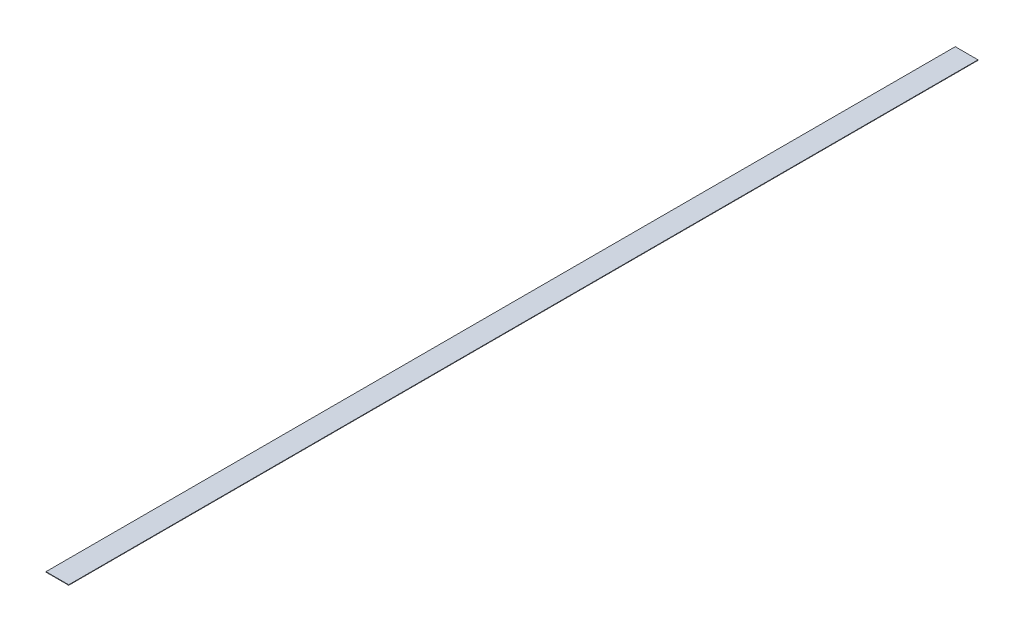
from build123d import *

# Parameters (mm, degrees)
SKETCH1_W           = 152.4
SKETCH1_H           = 6096
BOSS_EXTRUDE1_DEPTH = 3.175


with BuildPart() as part:
    # Sketch1 → Boss-Extrude1 (new body)
    with BuildSketch(Plane(origin=(0, 0, 0), x_dir=(1, 0, 0), z_dir=(0, 1, 0))):
        Rectangle(SKETCH1_W, SKETCH1_H)
    extrude(amount=BOSS_EXTRUDE1_DEPTH)


solid = part.part
